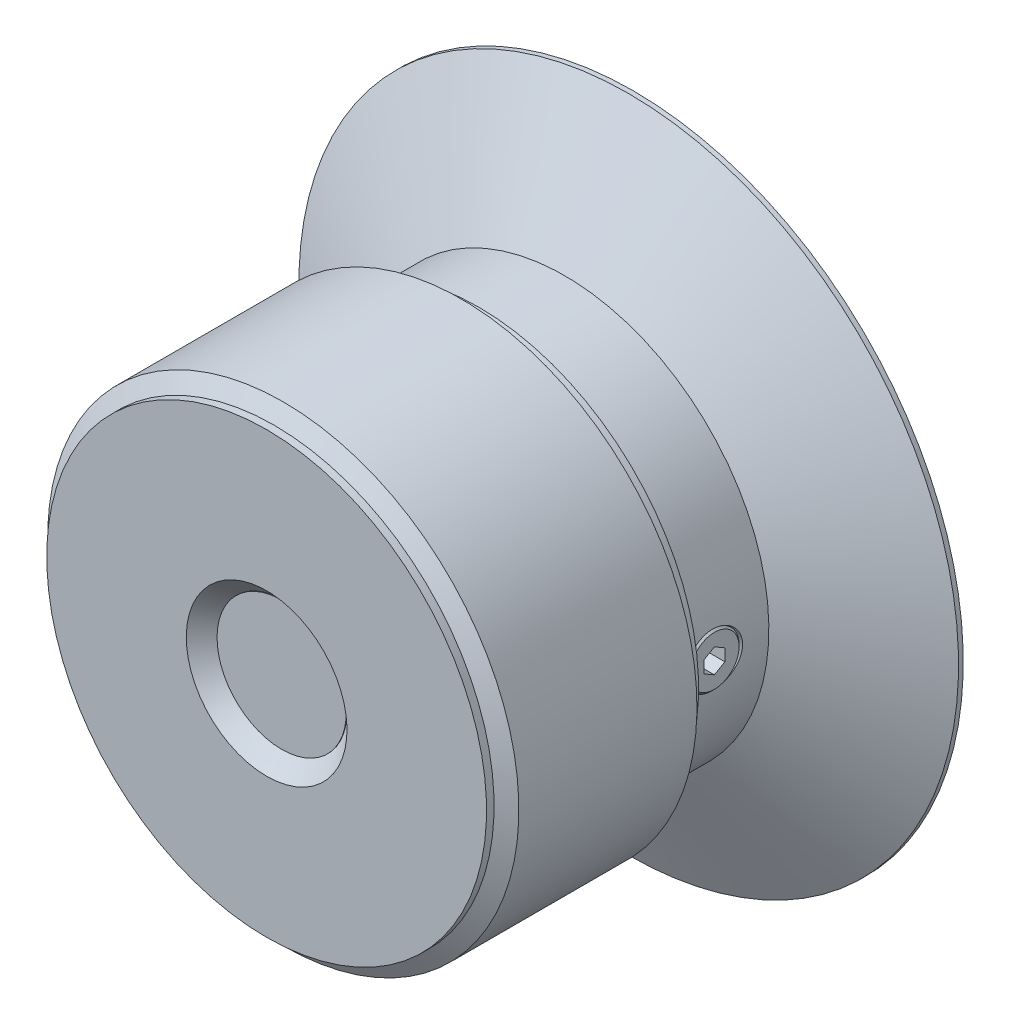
ISO-10303-21;
HEADER;
FILE_DESCRIPTION(('STEP AP214'),'2;1');
FILE_NAME('part.step','',(''),(''),'','','');
FILE_SCHEMA(('AUTOMOTIVE_DESIGN { 1 0 10303 214 1 1 1 1 }'));
ENDSEC;
DATA;
#1=APPLICATION_CONTEXT('core data for automotive mechanical design processes');
#2=APPLICATION_PROTOCOL_DEFINITION('international standard','automotive_design',2000,#1);
#3=PRODUCT_CONTEXT('',#1,'mechanical');
#4=PRODUCT('Part','Part','',(#3));
#5=PRODUCT_RELATED_PRODUCT_CATEGORY('part','',(#4));
#6=PRODUCT_DEFINITION_FORMATION('','',#4);
#7=PRODUCT_DEFINITION_CONTEXT('part definition',#1,'design');
#8=PRODUCT_DEFINITION('design','',#6,#7);
#9=PRODUCT_DEFINITION_SHAPE('','',#8);
#10=(LENGTH_UNIT() NAMED_UNIT(*) SI_UNIT(.MILLI.,.METRE.));
#11=(NAMED_UNIT(*) PLANE_ANGLE_UNIT() SI_UNIT($,.RADIAN.));
#12=(NAMED_UNIT(*) SI_UNIT($,.STERADIAN.) SOLID_ANGLE_UNIT());
#13=UNCERTAINTY_MEASURE_WITH_UNIT(LENGTH_MEASURE(1.E-05),#10,'distance_accuracy_value','');
#14=(GEOMETRIC_REPRESENTATION_CONTEXT(3) GLOBAL_UNCERTAINTY_ASSIGNED_CONTEXT((#13)) GLOBAL_UNIT_ASSIGNED_CONTEXT((#10,
#11,#12)) REPRESENTATION_CONTEXT('',''));
#15=CARTESIAN_POINT('',(0.,0.,0.));
#16=DIRECTION('',(0.,0.,1.));
#17=DIRECTION('',(1.,0.,0.));
#18=AXIS2_PLACEMENT_3D('',#15,#16,#17);
#19=CARTESIAN_POINT('',(0.,0.,11.025));
#20=DIRECTION('',(0.,0.,1.));
#21=DIRECTION('',(0.,-1.,0.));
#22=AXIS2_PLACEMENT_3D('',#19,#20,#21);
#23=CONICAL_SURFACE('',#22,14.,1.0471975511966);
#24=CARTESIAN_POINT('',(0.,0.,11.28));
#25=DIRECTION('',(0.,0.,1.));
#26=DIRECTION('',(0.,-1.,0.));
#27=AXIS2_PLACEMENT_3D('',#24,#25,#26);
#28=CIRCLE('',#27,14.4416729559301);
#29=CARTESIAN_POINT('',(0.,-14.4416729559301,11.28));
#30=VERTEX_POINT('',#29);
#31=EDGE_CURVE('E131',#30,#30,#28,.F.);
#32=ORIENTED_EDGE('',*,*,#31,.F.);
#33=EDGE_LOOP('',(#32));
#34=FACE_BOUND('',#33,.T.);
#35=CARTESIAN_POINT('',(0.,0.,11.6023502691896));
#36=DIRECTION('',(0.,0.,1.));
#37=DIRECTION('',(0.,-1.,0.));
#38=AXIS2_PLACEMENT_3D('',#35,#36,#37);
#39=CIRCLE('',#38,15.);
#40=CARTESIAN_POINT('',(0.,-15.,11.6023502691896));
#41=VERTEX_POINT('',#40);
#42=EDGE_CURVE('E126',#41,#41,#39,.T.);
#43=ORIENTED_EDGE('',*,*,#42,.F.);
#44=EDGE_LOOP('',(#43));
#45=FACE_BOUND('',#44,.T.);
#46=ADVANCED_FACE('F14',(#34,#45),#23,.T.);
#47=CARTESIAN_POINT('',(14.,0.,11.28));
#48=DIRECTION('',(0.,0.,1.));
#49=DIRECTION('',(0.,-1.,0.));
#50=AXIS2_PLACEMENT_3D('',#47,#48,#49);
#51=PLANE('',#50);
#52=ORIENTED_EDGE('',*,*,#31,.T.);
#53=EDGE_LOOP('',(#52));
#54=FACE_BOUND('',#53,.T.);
#55=CARTESIAN_POINT('',(0.,0.,11.28));
#56=DIRECTION('',(0.,0.,1.));
#57=DIRECTION('',(0.,-1.,0.));
#58=AXIS2_PLACEMENT_3D('',#55,#56,#57);
#59=CIRCLE('',#58,14.);
#60=CARTESIAN_POINT('',(0.,-14.,11.28));
#61=VERTEX_POINT('',#60);
#62=EDGE_CURVE('E263',#61,#61,#59,.T.);
#63=ORIENTED_EDGE('',*,*,#62,.T.);
#64=EDGE_LOOP('',(#63));
#65=FACE_BOUND('',#64,.T.);
#66=ADVANCED_FACE('F183',(#54,#65),#51,.F.);
#67=CARTESIAN_POINT('',(0.,0.,24.));
#68=DIRECTION('',(0.,0.,1.));
#69=DIRECTION('',(0.,-1.,0.));
#70=AXIS2_PLACEMENT_3D('',#67,#68,#69);
#71=CYLINDRICAL_SURFACE('',#70,14.);
#72=ORIENTED_EDGE('',*,*,#62,.F.);
#73=EDGE_LOOP('',(#72));
#74=FACE_BOUND('',#73,.T.);
#75=CARTESIAN_POINT('',(0.,0.,10.5));
#76=DIRECTION('',(0.,0.,1.));
#77=DIRECTION('',(0.,-1.,0.));
#78=AXIS2_PLACEMENT_3D('',#75,#76,#77);
#79=CIRCLE('',#78,14.);
#80=CARTESIAN_POINT('',(0.,-14.,10.5));
#81=VERTEX_POINT('',#80);
#82=EDGE_CURVE('E260',#81,#81,#79,.T.);
#83=ORIENTED_EDGE('',*,*,#82,.T.);
#84=EDGE_LOOP('',(#83));
#85=FACE_BOUND('',#84,.T.);
#86=ADVANCED_FACE('F186',(#74,#85),#71,.T.);
#87=CARTESIAN_POINT('',(13.,0.,10.5));
#88=DIRECTION('',(0.,0.,1.));
#89=DIRECTION('',(0.,-1.,0.));
#90=AXIS2_PLACEMENT_3D('',#87,#88,#89);
#91=PLANE('',#90);
#92=ORIENTED_EDGE('',*,*,#82,.F.);
#93=EDGE_LOOP('',(#92));
#94=FACE_BOUND('',#93,.T.);
#95=CARTESIAN_POINT('',(0.,0.,10.5));
#96=DIRECTION('',(0.,0.,1.));
#97=DIRECTION('',(0.,-1.,0.));
#98=AXIS2_PLACEMENT_3D('',#95,#96,#97);
#99=CIRCLE('',#98,13.);
#100=CARTESIAN_POINT('',(0.,-13.,10.5));
#101=VERTEX_POINT('',#100);
#102=EDGE_CURVE('E257',#101,#101,#99,.T.);
#103=ORIENTED_EDGE('',*,*,#102,.T.);
#104=EDGE_LOOP('',(#103));
#105=FACE_BOUND('',#104,.T.);
#106=ADVANCED_FACE('F189',(#94,#105),#91,.F.);
#107=CARTESIAN_POINT('',(0.,0.,24.));
#108=DIRECTION('',(0.,0.,1.));
#109=DIRECTION('',(0.,-1.,0.));
#110=AXIS2_PLACEMENT_3D('',#107,#108,#109);
#111=CYLINDRICAL_SURFACE('',#110,13.);
#112=ORIENTED_EDGE('',*,*,#102,.F.);
#113=EDGE_LOOP('',(#112));
#114=FACE_BOUND('',#113,.T.);
#115=CARTESIAN_POINT('',(12.9431972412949,-1.2139378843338,7.24896385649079));
#116=CARTESIAN_POINT('',(12.9486321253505,-1.15598715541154,7.18515845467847));
#117=CARTESIAN_POINT('',(12.95411531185,-1.09333814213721,7.12561511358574));
#118=CARTESIAN_POINT('',(12.9646981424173,-0.959734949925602,7.01659920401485));
#119=CARTESIAN_POINT('',(12.9697976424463,-0.888777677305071,6.96713040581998));
#120=CARTESIAN_POINT('',(12.9796922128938,-0.731114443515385,6.8745582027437));
#121=CARTESIAN_POINT('',(12.9843791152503,-0.643539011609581,6.83290954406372));
#122=CARTESIAN_POINT('',(12.9920939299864,-0.462285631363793,6.76586842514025));
#123=CARTESIAN_POINT('',(12.9951219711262,-0.368608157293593,6.74047470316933));
#124=CARTESIAN_POINT('',(12.9990116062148,-0.183704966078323,6.70807803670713));
#125=CARTESIAN_POINT('',(12.9999889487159,-0.0926534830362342,6.700091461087));
#126=CARTESIAN_POINT('',(13.0000108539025,0.089449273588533,6.69991016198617));
#127=CARTESIAN_POINT('',(12.9990559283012,0.180500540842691,6.70771125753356));
#128=CARTESIAN_POINT('',(12.9953821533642,0.357267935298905,6.73830549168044));
#129=CARTESIAN_POINT('',(12.9927152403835,0.443062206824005,6.76065747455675));
#130=CARTESIAN_POINT('',(12.9859588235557,0.609788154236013,6.81904806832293));
#131=CARTESIAN_POINT('',(12.9818691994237,0.690719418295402,6.85508783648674));
#132=CARTESIAN_POINT('',(12.9725844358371,0.84757191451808,6.94057061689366));
#133=CARTESIAN_POINT('',(12.9673654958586,0.923329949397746,6.99030972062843));
#134=CARTESIAN_POINT('',(12.9564197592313,1.06598100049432,7.10113316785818));
#135=CARTESIAN_POINT('',(12.9506928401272,1.13287186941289,7.16222025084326));
#136=CARTESIAN_POINT('',(12.9389544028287,1.2600718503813,7.29780227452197));
#137=CARTESIAN_POINT('',(12.9329457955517,1.31976847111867,7.37287188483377));
#138=CARTESIAN_POINT('',(12.9216017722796,1.42656910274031,7.53153062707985));
#139=CARTESIAN_POINT('',(12.9162665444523,1.47366959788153,7.61512212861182));
#140=CARTESIAN_POINT('',(12.9065129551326,1.55685279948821,7.79384493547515));
#141=CARTESIAN_POINT('',(12.902168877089,1.59210418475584,7.88936776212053));
#142=CARTESIAN_POINT('',(12.8952989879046,1.64682337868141,8.08489536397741));
#143=CARTESIAN_POINT('',(12.8927735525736,1.66628792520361,8.18490106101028));
#144=CARTESIAN_POINT('',(12.8897539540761,1.68949455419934,8.39056335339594));
#145=CARTESIAN_POINT('',(12.8893395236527,1.69261960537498,8.49629121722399));
#146=CARTESIAN_POINT('',(12.8908053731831,1.68141790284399,8.70681077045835));
#147=CARTESIAN_POINT('',(12.8926859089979,1.6670892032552,8.81160235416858));
#148=CARTESIAN_POINT('',(12.8985577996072,1.62103305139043,9.01832956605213));
#149=CARTESIAN_POINT('',(12.9025698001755,1.58913530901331,9.1202268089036));
#150=CARTESIAN_POINT('',(12.9122474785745,1.50847810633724,9.31705123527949));
#151=CARTESIAN_POINT('',(12.9179131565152,1.45971864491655,9.41197841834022));
#152=CARTESIAN_POINT('',(12.9301074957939,1.34738479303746,9.59027531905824));
#153=CARTESIAN_POINT('',(12.9366194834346,1.28408204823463,9.67381694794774));
#154=CARTESIAN_POINT('',(12.9497856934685,1.14367968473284,9.82838089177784));
#155=CARTESIAN_POINT('',(12.9564398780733,1.06658369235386,9.89940648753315));
#156=CARTESIAN_POINT('',(12.9687264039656,0.904652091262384,10.023101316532));
#157=CARTESIAN_POINT('',(12.9743926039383,0.820371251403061,10.0764922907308));
#158=CARTESIAN_POINT('',(12.9843644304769,0.64350485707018,10.1672429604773));
#159=CARTESIAN_POINT('',(12.9886707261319,0.550923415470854,10.2046105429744));
#160=CARTESIAN_POINT('',(12.9951321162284,0.366698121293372,10.2597300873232));
#161=CARTESIAN_POINT('',(12.9974106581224,0.275397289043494,10.2786160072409));
#162=CARTESIAN_POINT('',(13.0000092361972,0.0908797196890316,10.3001087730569));
#163=CARTESIAN_POINT('',(13.0003298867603,-0.00233640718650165,10.3027207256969));
#164=CARTESIAN_POINT('',(12.9990054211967,-0.183619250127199,10.2918100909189));
#165=CARTESIAN_POINT('',(12.9974471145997,-0.271730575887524,10.2790000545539));
#166=CARTESIAN_POINT('',(12.9926844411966,-0.444552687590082,10.2389514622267));
#167=CARTESIAN_POINT('',(12.9894800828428,-0.52926349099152,10.2117129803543));
#168=CARTESIAN_POINT('',(12.9817461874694,-0.693604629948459,10.1436187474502));
#169=CARTESIAN_POINT('',(12.9772078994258,-0.773197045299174,10.1026728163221));
#170=CARTESIAN_POINT('',(12.9672876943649,-0.924786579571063,10.0086453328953));
#171=CARTESIAN_POINT('',(12.9619056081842,-0.996782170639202,9.95556134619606));
#172=CARTESIAN_POINT('',(12.9505479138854,-1.13506323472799,9.83595881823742));
#173=CARTESIAN_POINT('',(12.9445560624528,-1.20087773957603,9.76889783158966));
#174=CARTESIAN_POINT('',(12.9328387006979,-1.32111359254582,9.62522707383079));
#175=CARTESIAN_POINT('',(12.9271132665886,-1.37553169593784,9.54861459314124));
#176=CARTESIAN_POINT('',(12.9161522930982,-1.47501837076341,9.38282948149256));
#177=CARTESIAN_POINT('',(12.9109703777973,-1.51928144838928,9.29316954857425));
#178=CARTESIAN_POINT('',(12.9020876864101,-1.59295783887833,9.10787719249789));
#179=CARTESIAN_POINT('',(12.8983872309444,-1.62236793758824,9.01224348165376));
#180=CARTESIAN_POINT('',(12.8927224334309,-1.66680583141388,8.81297257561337));
#181=CARTESIAN_POINT('',(12.8908463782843,-1.68110490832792,8.70916981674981));
#182=CARTESIAN_POINT('',(12.8893456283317,-1.69257262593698,8.50058694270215));
#183=CARTESIAN_POINT('',(12.889721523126,-1.68973678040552,8.39580657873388));
#184=CARTESIAN_POINT('',(12.8927120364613,-1.66676732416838,8.18617317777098));
#185=CARTESIAN_POINT('',(12.8953689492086,-1.64630689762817,8.08135639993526));
#186=CARTESIAN_POINT('',(12.9026710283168,-1.58806063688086,7.87674996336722));
#187=CARTESIAN_POINT('',(12.9073151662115,-1.55028376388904,7.77695773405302));
#188=CARTESIAN_POINT('',(12.9170722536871,-1.46651756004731,7.60264189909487));
#189=CARTESIAN_POINT('',(12.9219511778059,-1.4232219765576,7.52679908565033));
#190=CARTESIAN_POINT('',(12.9322695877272,-1.32619043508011,7.3821790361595));
#191=CARTESIAN_POINT('',(12.9377087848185,-1.27245984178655,7.31339819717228));
#192=CARTESIAN_POINT('',(12.9431972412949,-1.2139378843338,7.24896385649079));
#193=B_SPLINE_CURVE_WITH_KNOTS('',3,(#115,#116,#117,#118,#119,#120,#121,#122,#123,#124,#125,
#126,#127,#128,#129,#130,#131,#132,#133,#134,#135,#136,#137,#138,#139,#140,#141,#142,#143,#144,
#145,#146,#147,#148,#149,#150,#151,#152,#153,#154,#155,#156,#157,#158,#159,#160,#161,#162,#163,
#164,#165,#166,#167,#168,#169,#170,#171,#172,#173,#174,#175,#176,#177,#178,#179,#180,#181,#182,
#183,#184,#185,#186,#187,#188,#189,#190,#191,#192),.UNSPECIFIED.,.T.,.F.,(4,2,2,2,2,2,2,2,2,2,2,
2,2,2,2,2,2,2,2,2,2,2,2,2,2,2,2,2,2,2,2,2,2,2,2,2,2,2,4),(0.,0.258856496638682,
0.517809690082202,0.807531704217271,1.0972312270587,1.37008332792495,1.64286318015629,
1.90773549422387,2.17263020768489,2.44377298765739,2.71498130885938,3.00202784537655,
3.28915441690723,3.59352050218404,3.89794946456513,4.21379569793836,4.52967714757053,
4.84867561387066,5.16767410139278,5.48113933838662,5.79452228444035,6.09274637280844,
6.39082350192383,6.66918488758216,6.94745891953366,7.21335437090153,7.47924845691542,
7.74692738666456,8.01466004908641,8.29589258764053,8.57720508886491,8.87624874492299,
9.17535708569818,9.4883101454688,9.80134514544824,10.1203129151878,10.4391158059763,
10.7006579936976,10.9620660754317),.UNSPECIFIED.);
#194=CARTESIAN_POINT('',(12.9431972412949,-1.2139378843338,7.24896385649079));
#195=VERTEX_POINT('',#194);
#196=EDGE_CURVE('E143',#195,#195,#193,.T.);
#197=ORIENTED_EDGE('',*,*,#196,.F.);
#198=EDGE_LOOP('',(#197));
#199=FACE_BOUND('',#198,.T.);
#200=CARTESIAN_POINT('',(0.,0.,5.02620359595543));
#201=DIRECTION('',(0.,0.,1.));
#202=DIRECTION('',(0.,-1.,0.));
#203=AXIS2_PLACEMENT_3D('',#200,#201,#202);
#204=CIRCLE('',#203,13.);
#205=CARTESIAN_POINT('',(0.,-13.,5.02620359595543));
#206=VERTEX_POINT('',#205);
#207=EDGE_CURVE('E254',#206,#206,#204,.T.);
#208=ORIENTED_EDGE('',*,*,#207,.T.);
#209=EDGE_LOOP('',(#208));
#210=FACE_BOUND('',#209,.T.);
#211=ADVANCED_FACE('F153',(#114,#199,#210),#111,.T.);
#212=CARTESIAN_POINT('',(13.2,0.,8.5));
#213=DIRECTION('',(1.,0.,0.));
#214=DIRECTION('',(0.,0.,-1.));
#215=AXIS2_PLACEMENT_3D('',#212,#213,#214);
#216=CONICAL_SURFACE('',#215,2.,0.78539816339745);
#217=ORIENTED_EDGE('',*,*,#196,.T.);
#218=EDGE_LOOP('',(#217));
#219=FACE_BOUND('',#218,.T.);
#220=CARTESIAN_POINT('',(12.8880760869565,0.,8.5));
#221=DIRECTION('',(-1.,0.,0.));
#222=DIRECTION('',(0.,-1.,0.));
#223=AXIS2_PLACEMENT_3D('',#220,#221,#222);
#224=CIRCLE('',#223,1.68807608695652);
#225=CARTESIAN_POINT('',(12.8880760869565,-1.68807608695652,8.5));
#226=VERTEX_POINT('',#225);
#227=EDGE_CURVE('E95',#226,#226,#224,.T.);
#228=ORIENTED_EDGE('',*,*,#227,.T.);
#229=EDGE_LOOP('',(#228));
#230=FACE_BOUND('',#229,.T.);
#231=ADVANCED_FACE('F157',(#219,#230),#216,.F.);
#232=CARTESIAN_POINT('',(0.,0.,0.95));
#233=DIRECTION('',(0.,0.,-1.));
#234=DIRECTION('',(0.,1.,0.));
#235=AXIS2_PLACEMENT_3D('',#232,#233,#234);
#236=CONICAL_SURFACE('',#235,21.,1.09955742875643);
#237=ORIENTED_EDGE('',*,*,#207,.F.);
#238=EDGE_LOOP('',(#237));
#239=FACE_BOUND('',#238,.T.);
#240=CARTESIAN_POINT('',(0.,0.,0.95));
#241=DIRECTION('',(0.,0.,1.));
#242=DIRECTION('',(0.,-1.,0.));
#243=AXIS2_PLACEMENT_3D('',#240,#241,#242);
#244=CIRCLE('',#243,21.);
#245=CARTESIAN_POINT('',(0.,-21.,0.95));
#246=VERTEX_POINT('',#245);
#247=EDGE_CURVE('E251',#246,#246,#244,.T.);
#248=ORIENTED_EDGE('',*,*,#247,.T.);
#249=EDGE_LOOP('',(#248));
#250=FACE_BOUND('',#249,.T.);
#251=ADVANCED_FACE('F162',(#239,#250),#236,.T.);
#252=CARTESIAN_POINT('',(13.005652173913,0.,8.5));
#253=DIRECTION('',(-1.,0.,0.));
#254=DIRECTION('',(0.,-1.,0.));
#255=AXIS2_PLACEMENT_3D('',#252,#253,#254);
#256=CONICAL_SURFACE('',#255,1.5705,0.785398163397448);
#257=ORIENTED_EDGE('',*,*,#227,.F.);
#258=EDGE_LOOP('',(#257));
#259=FACE_BOUND('',#258,.T.);
#260=CARTESIAN_POINT('',(13.005652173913,0.,8.5));
#261=DIRECTION('',(-1.,0.,0.));
#262=DIRECTION('',(0.,-1.,0.));
#263=AXIS2_PLACEMENT_3D('',#260,#261,#262);
#264=CIRCLE('',#263,1.5705);
#265=CARTESIAN_POINT('',(13.005652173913,-1.5705,8.5));
#266=VERTEX_POINT('',#265);
#267=EDGE_CURVE('E74',#266,#266,#264,.T.);
#268=ORIENTED_EDGE('',*,*,#267,.T.);
#269=EDGE_LOOP('',(#268));
#270=FACE_BOUND('',#269,.T.);
#271=ADVANCED_FACE('F291',(#259,#270),#256,.T.);
#272=CARTESIAN_POINT('',(0.,0.,24.));
#273=DIRECTION('',(0.,0.,1.));
#274=DIRECTION('',(0.,-1.,0.));
#275=AXIS2_PLACEMENT_3D('',#272,#273,#274);
#276=CYLINDRICAL_SURFACE('',#275,21.);
#277=ORIENTED_EDGE('',*,*,#247,.F.);
#278=EDGE_LOOP('',(#277));
#279=FACE_BOUND('',#278,.T.);
#280=CARTESIAN_POINT('',(0.,0.,0.65));
#281=DIRECTION('',(0.,0.,1.));
#282=DIRECTION('',(0.,-1.,0.));
#283=AXIS2_PLACEMENT_3D('',#280,#281,#282);
#284=CIRCLE('',#283,21.);
#285=CARTESIAN_POINT('',(0.,-21.,0.65));
#286=VERTEX_POINT('',#285);
#287=EDGE_CURVE('E248',#286,#286,#284,.T.);
#288=ORIENTED_EDGE('',*,*,#287,.T.);
#289=EDGE_LOOP('',(#288));
#290=FACE_BOUND('',#289,.T.);
#291=ADVANCED_FACE('F294',(#279,#290),#276,.T.);
#292=CARTESIAN_POINT('',(13.005652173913,0.,8.5));
#293=DIRECTION('',(-1.,0.,0.));
#294=DIRECTION('',(0.,-1.,0.));
#295=AXIS2_PLACEMENT_3D('',#292,#293,#294);
#296=PLANE('',#295);
#297=ORIENTED_EDGE('',*,*,#267,.F.);
#298=EDGE_LOOP('',(#297));
#299=FACE_BOUND('',#298,.T.);
#300=DIRECTION('',(0.,1.,0.));
#301=VECTOR('',#300,1.);
#302=CARTESIAN_POINT('',(13.005652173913,0.,7.83333333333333));
#303=LINE('',#302,#301);
#304=CARTESIAN_POINT('',(13.005652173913,-0.384900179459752,7.83333333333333));
#305=VERTEX_POINT('',#304);
#306=CARTESIAN_POINT('',(13.005652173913,0.384900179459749,7.83333333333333));
#307=VERTEX_POINT('',#306);
#308=EDGE_CURVE('E18',#305,#307,#303,.T.);
#309=ORIENTED_EDGE('',*,*,#308,.F.);
#310=DIRECTION('',(0.,0.5,-0.866025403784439));
#311=VECTOR('',#310,1.);
#312=CARTESIAN_POINT('',(13.005652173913,-0.577350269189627,8.16666666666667));
#313=LINE('',#312,#311);
#314=CARTESIAN_POINT('',(13.005652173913,-0.769800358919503,8.5));
#315=VERTEX_POINT('',#314);
#316=EDGE_CURVE('E115',#315,#305,#313,.T.);
#317=ORIENTED_EDGE('',*,*,#316,.F.);
#318=DIRECTION('',(0.,-0.5,-0.866025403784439));
#319=VECTOR('',#318,1.);
#320=CARTESIAN_POINT('',(13.005652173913,-0.577350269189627,8.83333333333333));
#321=LINE('',#320,#319);
#322=CARTESIAN_POINT('',(13.005652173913,-0.384900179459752,9.16666666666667));
#323=VERTEX_POINT('',#322);
#324=EDGE_CURVE('E117',#323,#315,#321,.T.);
#325=ORIENTED_EDGE('',*,*,#324,.F.);
#326=DIRECTION('',(0.,-1.,0.));
#327=VECTOR('',#326,1.);
#328=CARTESIAN_POINT('',(13.005652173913,0.,9.16666666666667));
#329=LINE('',#328,#327);
#330=CARTESIAN_POINT('',(13.005652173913,0.384900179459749,9.16666666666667));
#331=VERTEX_POINT('',#330);
#332=EDGE_CURVE('E119',#331,#323,#329,.T.);
#333=ORIENTED_EDGE('',*,*,#332,.F.);
#334=DIRECTION('',(0.,-0.5,0.866025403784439));
#335=VECTOR('',#334,1.);
#336=CARTESIAN_POINT('',(13.005652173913,0.577350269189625,8.83333333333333));
#337=LINE('',#336,#335);
#338=CARTESIAN_POINT('',(13.005652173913,0.7698003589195,8.5));
#339=VERTEX_POINT('',#338);
#340=EDGE_CURVE('E121',#339,#331,#337,.T.);
#341=ORIENTED_EDGE('',*,*,#340,.F.);
#342=DIRECTION('',(0.,0.5,0.866025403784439));
#343=VECTOR('',#342,1.);
#344=CARTESIAN_POINT('',(13.005652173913,0.577350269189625,8.16666666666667));
#345=LINE('',#344,#343);
#346=EDGE_CURVE('E123',#307,#339,#345,.T.);
#347=ORIENTED_EDGE('',*,*,#346,.F.);
#348=EDGE_LOOP('',(#309,#317,#325,#333,#341,#347));
#349=FACE_BOUND('',#348,.T.);
#350=ADVANCED_FACE('F16',(#299,#349),#296,.F.);
#351=CARTESIAN_POINT('',(6.6,0.,0.65));
#352=DIRECTION('',(0.,0.,1.));
#353=DIRECTION('',(0.,-1.,0.));
#354=AXIS2_PLACEMENT_3D('',#351,#352,#353);
#355=PLANE('',#354);
#356=ORIENTED_EDGE('',*,*,#287,.F.);
#357=EDGE_LOOP('',(#356));
#358=FACE_BOUND('',#357,.T.);
#359=CARTESIAN_POINT('',(0.,0.,0.65));
#360=DIRECTION('',(0.,0.,1.));
#361=DIRECTION('',(0.,-1.,0.));
#362=AXIS2_PLACEMENT_3D('',#359,#360,#361);
#363=CIRCLE('',#362,6.6);
#364=CARTESIAN_POINT('',(0.,-6.6,0.65));
#365=VERTEX_POINT('',#364);
#366=EDGE_CURVE('E245',#365,#365,#363,.T.);
#367=ORIENTED_EDGE('',*,*,#366,.T.);
#368=EDGE_LOOP('',(#367));
#369=FACE_BOUND('',#368,.T.);
#370=ADVANCED_FACE('F300',(#358,#369),#355,.F.);
#371=CARTESIAN_POINT('',(15.,-0.384900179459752,7.83333333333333));
#372=DIRECTION('',(0.,0.,1.));
#373=DIRECTION('',(0.,-1.,0.));
#374=AXIS2_PLACEMENT_3D('',#371,#372,#373);
#375=PLANE('',#374);
#376=ORIENTED_EDGE('',*,*,#308,.T.);
#377=DIRECTION('',(-1.,0.,0.));
#378=VECTOR('',#377,1.);
#379=CARTESIAN_POINT('',(15.,0.384900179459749,7.83333333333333));
#380=LINE('',#379,#378);
#381=CARTESIAN_POINT('',(11.,0.384900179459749,7.83333333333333));
#382=VERTEX_POINT('',#381);
#383=EDGE_CURVE('E67',#307,#382,#380,.T.);
#384=ORIENTED_EDGE('',*,*,#383,.T.);
#385=DIRECTION('',(0.,1.,0.));
#386=VECTOR('',#385,1.);
#387=CARTESIAN_POINT('',(11.,-0.384900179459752,7.83333333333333));
#388=LINE('',#387,#386);
#389=CARTESIAN_POINT('',(11.,-0.384900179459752,7.83333333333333));
#390=VERTEX_POINT('',#389);
#391=EDGE_CURVE('E71',#390,#382,#388,.T.);
#392=ORIENTED_EDGE('',*,*,#391,.F.);
#393=DIRECTION('',(-1.,0.,0.));
#394=VECTOR('',#393,1.);
#395=CARTESIAN_POINT('',(15.,-0.384900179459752,7.83333333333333));
#396=LINE('',#395,#394);
#397=EDGE_CURVE('E105',#305,#390,#396,.T.);
#398=ORIENTED_EDGE('',*,*,#397,.F.);
#399=EDGE_LOOP('',(#376,#384,#392,#398));
#400=FACE_BOUND('',#399,.T.);
#401=ADVANCED_FACE('F69',(#400),#375,.T.);
#402=CARTESIAN_POINT('',(15.,-0.769800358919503,8.5));
#403=DIRECTION('',(0.,0.866025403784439,0.5));
#404=DIRECTION('',(0.,-0.5,0.866025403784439));
#405=AXIS2_PLACEMENT_3D('',#402,#403,#404);
#406=PLANE('',#405);
#407=ORIENTED_EDGE('',*,*,#316,.T.);
#408=ORIENTED_EDGE('',*,*,#397,.T.);
#409=DIRECTION('',(0.,0.5,-0.866025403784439));
#410=VECTOR('',#409,1.);
#411=CARTESIAN_POINT('',(11.,-0.769800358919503,8.5));
#412=LINE('',#411,#410);
#413=CARTESIAN_POINT('',(11.,-0.769800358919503,8.5));
#414=VERTEX_POINT('',#413);
#415=EDGE_CURVE('E89',#414,#390,#412,.T.);
#416=ORIENTED_EDGE('',*,*,#415,.F.);
#417=DIRECTION('',(-1.,0.,0.));
#418=VECTOR('',#417,1.);
#419=CARTESIAN_POINT('',(15.,-0.769800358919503,8.5));
#420=LINE('',#419,#418);
#421=EDGE_CURVE('E31',#315,#414,#420,.T.);
#422=ORIENTED_EDGE('',*,*,#421,.F.);
#423=EDGE_LOOP('',(#407,#408,#416,#422));
#424=FACE_BOUND('',#423,.T.);
#425=ADVANCED_FACE('F329',(#424),#406,.T.);
#426=CARTESIAN_POINT('',(15.,-0.384900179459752,9.16666666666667));
#427=DIRECTION('',(0.,0.866025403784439,-0.5));
#428=DIRECTION('',(0.,0.5,0.866025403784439));
#429=AXIS2_PLACEMENT_3D('',#426,#427,#428);
#430=PLANE('',#429);
#431=ORIENTED_EDGE('',*,*,#324,.T.);
#432=ORIENTED_EDGE('',*,*,#421,.T.);
#433=DIRECTION('',(0.,-0.5,-0.866025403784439));
#434=VECTOR('',#433,1.);
#435=CARTESIAN_POINT('',(11.,-0.384900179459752,9.16666666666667));
#436=LINE('',#435,#434);
#437=CARTESIAN_POINT('',(11.,-0.384900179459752,9.16666666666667));
#438=VERTEX_POINT('',#437);
#439=EDGE_CURVE('E102',#438,#414,#436,.T.);
#440=ORIENTED_EDGE('',*,*,#439,.F.);
#441=DIRECTION('',(-1.,0.,0.));
#442=VECTOR('',#441,1.);
#443=CARTESIAN_POINT('',(15.,-0.384900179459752,9.16666666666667));
#444=LINE('',#443,#442);
#445=EDGE_CURVE('E108',#323,#438,#444,.T.);
#446=ORIENTED_EDGE('',*,*,#445,.F.);
#447=EDGE_LOOP('',(#431,#432,#440,#446));
#448=FACE_BOUND('',#447,.T.);
#449=ADVANCED_FACE('F332',(#448),#430,.T.);
#450=CARTESIAN_POINT('',(15.,0.384900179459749,9.16666666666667));
#451=DIRECTION('',(0.,0.,-1.));
#452=DIRECTION('',(0.,1.,0.));
#453=AXIS2_PLACEMENT_3D('',#450,#451,#452);
#454=PLANE('',#453);
#455=DIRECTION('',(-1.,0.,0.));
#456=VECTOR('',#455,1.);
#457=CARTESIAN_POINT('',(15.,0.384900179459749,9.16666666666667));
#458=LINE('',#457,#456);
#459=CARTESIAN_POINT('',(11.,0.384900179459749,9.16666666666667));
#460=VERTEX_POINT('',#459);
#461=EDGE_CURVE('E110',#331,#460,#458,.T.);
#462=ORIENTED_EDGE('',*,*,#461,.F.);
#463=ORIENTED_EDGE('',*,*,#332,.T.);
#464=ORIENTED_EDGE('',*,*,#445,.T.);
#465=DIRECTION('',(0.,-1.,0.));
#466=VECTOR('',#465,1.);
#467=CARTESIAN_POINT('',(11.,0.384900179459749,9.16666666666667));
#468=LINE('',#467,#466);
#469=EDGE_CURVE('E99',#460,#438,#468,.T.);
#470=ORIENTED_EDGE('',*,*,#469,.F.);
#471=EDGE_LOOP('',(#462,#463,#464,#470));
#472=FACE_BOUND('',#471,.T.);
#473=ADVANCED_FACE('F335',(#472),#454,.T.);
#474=CARTESIAN_POINT('',(15.,0.7698003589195,8.5));
#475=DIRECTION('',(0.,-0.866025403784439,-0.5));
#476=DIRECTION('',(0.,0.5,-0.866025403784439));
#477=AXIS2_PLACEMENT_3D('',#474,#475,#476);
#478=PLANE('',#477);
#479=ORIENTED_EDGE('',*,*,#340,.T.);
#480=ORIENTED_EDGE('',*,*,#461,.T.);
#481=DIRECTION('',(0.,-0.5,0.866025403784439));
#482=VECTOR('',#481,1.);
#483=CARTESIAN_POINT('',(11.,0.7698003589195,8.5));
#484=LINE('',#483,#482);
#485=CARTESIAN_POINT('',(11.,0.7698003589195,8.5));
#486=VERTEX_POINT('',#485);
#487=EDGE_CURVE('E84',#486,#460,#484,.T.);
#488=ORIENTED_EDGE('',*,*,#487,.F.);
#489=DIRECTION('',(-1.,0.,0.));
#490=VECTOR('',#489,1.);
#491=CARTESIAN_POINT('',(15.,0.7698003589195,8.5));
#492=LINE('',#491,#490);
#493=EDGE_CURVE('E75',#339,#486,#492,.T.);
#494=ORIENTED_EDGE('',*,*,#493,.F.);
#495=EDGE_LOOP('',(#479,#480,#488,#494));
#496=FACE_BOUND('',#495,.T.);
#497=ADVANCED_FACE('F339',(#496),#478,.T.);
#498=CARTESIAN_POINT('',(15.,0.384900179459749,7.83333333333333));
#499=DIRECTION('',(0.,-0.866025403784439,0.5));
#500=DIRECTION('',(0.,-0.5,-0.866025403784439));
#501=AXIS2_PLACEMENT_3D('',#498,#499,#500);
#502=PLANE('',#501);
#503=ORIENTED_EDGE('',*,*,#346,.T.);
#504=ORIENTED_EDGE('',*,*,#493,.T.);
#505=DIRECTION('',(0.,0.5,0.866025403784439));
#506=VECTOR('',#505,1.);
#507=CARTESIAN_POINT('',(11.,0.384900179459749,7.83333333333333));
#508=LINE('',#507,#506);
#509=EDGE_CURVE('E78',#382,#486,#508,.T.);
#510=ORIENTED_EDGE('',*,*,#509,.F.);
#511=ORIENTED_EDGE('',*,*,#383,.F.);
#512=EDGE_LOOP('',(#503,#504,#510,#511));
#513=FACE_BOUND('',#512,.T.);
#514=ADVANCED_FACE('F79',(#513),#502,.T.);
#515=CARTESIAN_POINT('',(0.,0.,0.3));
#516=DIRECTION('',(0.,0.,1.));
#517=DIRECTION('',(0.,-1.,0.));
#518=AXIS2_PLACEMENT_3D('',#515,#516,#517);
#519=CONICAL_SURFACE('',#518,6.,1.04272187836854);
#520=ORIENTED_EDGE('',*,*,#366,.F.);
#521=EDGE_LOOP('',(#520));
#522=FACE_BOUND('',#521,.T.);
#523=CARTESIAN_POINT('',(0.,0.,0.3));
#524=DIRECTION('',(0.,0.,1.));
#525=DIRECTION('',(0.,-1.,0.));
#526=AXIS2_PLACEMENT_3D('',#523,#524,#525);
#527=CIRCLE('',#526,6.);
#528=CARTESIAN_POINT('',(0.,-6.,0.3));
#529=VERTEX_POINT('',#528);
#530=EDGE_CURVE('E240',#529,#529,#527,.T.);
#531=ORIENTED_EDGE('',*,*,#530,.T.);
#532=EDGE_LOOP('',(#531));
#533=FACE_BOUND('',#532,.T.);
#534=ADVANCED_FACE('F306',(#522,#533),#519,.T.);
#535=CARTESIAN_POINT('',(11.,0.,8.5));
#536=DIRECTION('',(1.,0.,0.));
#537=DIRECTION('',(0.,1.,0.));
#538=AXIS2_PLACEMENT_3D('',#535,#536,#537);
#539=PLANE('',#538);
#540=ORIENTED_EDGE('',*,*,#391,.T.);
#541=ORIENTED_EDGE('',*,*,#509,.T.);
#542=ORIENTED_EDGE('',*,*,#487,.T.);
#543=ORIENTED_EDGE('',*,*,#469,.T.);
#544=ORIENTED_EDGE('',*,*,#439,.T.);
#545=ORIENTED_EDGE('',*,*,#415,.T.);
#546=EDGE_LOOP('',(#540,#541,#542,#543,#544,#545));
#547=FACE_BOUND('',#546,.T.);
#548=ADVANCED_FACE('F87',(#547),#539,.T.);
#549=CARTESIAN_POINT('',(5.5,0.,0.3));
#550=DIRECTION('',(0.,0.,1.));
#551=DIRECTION('',(0.,-1.,0.));
#552=AXIS2_PLACEMENT_3D('',#549,#550,#551);
#553=PLANE('',#552);
#554=ORIENTED_EDGE('',*,*,#530,.F.);
#555=EDGE_LOOP('',(#554));
#556=FACE_BOUND('',#555,.T.);
#557=CARTESIAN_POINT('',(0.,0.,0.3));
#558=DIRECTION('',(0.,0.,1.));
#559=DIRECTION('',(0.,-1.,0.));
#560=AXIS2_PLACEMENT_3D('',#557,#558,#559);
#561=CIRCLE('',#560,5.5);
#562=CARTESIAN_POINT('',(0.,-5.5,0.3));
#563=VERTEX_POINT('',#562);
#564=EDGE_CURVE('E236',#563,#563,#561,.T.);
#565=ORIENTED_EDGE('',*,*,#564,.T.);
#566=EDGE_LOOP('',(#565));
#567=FACE_BOUND('',#566,.T.);
#568=ADVANCED_FACE('F312',(#556,#567),#553,.F.);
#569=CARTESIAN_POINT('',(0.,0.,24.));
#570=DIRECTION('',(0.,0.,1.));
#571=DIRECTION('',(0.,-1.,0.));
#572=AXIS2_PLACEMENT_3D('',#569,#570,#571);
#573=CYLINDRICAL_SURFACE('',#572,5.5);
#574=ORIENTED_EDGE('',*,*,#564,.F.);
#575=EDGE_LOOP('',(#574));
#576=FACE_BOUND('',#575,.T.);
#577=CARTESIAN_POINT('',(0.,0.,0.));
#578=DIRECTION('',(0.,0.,1.));
#579=DIRECTION('',(0.,-1.,0.));
#580=AXIS2_PLACEMENT_3D('',#577,#578,#579);
#581=CIRCLE('',#580,5.5);
#582=CARTESIAN_POINT('',(0.,-5.5,0.));
#583=VERTEX_POINT('',#582);
#584=EDGE_CURVE('E232',#583,#583,#581,.T.);
#585=ORIENTED_EDGE('',*,*,#584,.T.);
#586=EDGE_LOOP('',(#585));
#587=FACE_BOUND('',#586,.T.);
#588=ADVANCED_FACE('F315',(#576,#587),#573,.T.);
#589=CARTESIAN_POINT('',(0.,0.,0.));
#590=DIRECTION('',(0.,0.,1.));
#591=DIRECTION('',(0.,-1.,0.));
#592=AXIS2_PLACEMENT_3D('',#589,#590,#591);
#593=PLANE('',#592);
#594=ORIENTED_EDGE('',*,*,#584,.F.);
#595=EDGE_LOOP('',(#594));
#596=FACE_BOUND('',#595,.T.);
#597=CARTESIAN_POINT('',(0.,0.,0.));
#598=DIRECTION('',(0.,0.,1.));
#599=DIRECTION('',(0.,-1.,0.));
#600=AXIS2_PLACEMENT_3D('',#597,#598,#599);
#601=CIRCLE('',#600,2.7);
#602=CARTESIAN_POINT('',(0.,-2.7,0.));
#603=VERTEX_POINT('',#602);
#604=EDGE_CURVE('E140',#603,#603,#601,.T.);
#605=ORIENTED_EDGE('',*,*,#604,.T.);
#606=EDGE_LOOP('',(#605));
#607=FACE_BOUND('',#606,.T.);
#608=ADVANCED_FACE('F211',(#596,#607),#593,.F.);
#609=CARTESIAN_POINT('',(0.,0.,0.));
#610=DIRECTION('',(0.,0.,-1.));
#611=DIRECTION('',(0.,1.,0.));
#612=AXIS2_PLACEMENT_3D('',#609,#610,#611);
#613=CONICAL_SURFACE('',#612,2.7,0.785398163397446);
#614=CARTESIAN_POINT('',(0.,0.,0.2));
#615=DIRECTION('',(0.,0.,1.));
#616=DIRECTION('',(0.,-1.,0.));
#617=AXIS2_PLACEMENT_3D('',#614,#615,#616);
#618=CIRCLE('',#617,2.5);
#619=CARTESIAN_POINT('',(0.,-2.5,0.2));
#620=VERTEX_POINT('',#619);
#621=EDGE_CURVE('E137',#620,#620,#618,.T.);
#622=ORIENTED_EDGE('',*,*,#621,.T.);
#623=EDGE_LOOP('',(#622));
#624=FACE_BOUND('',#623,.T.);
#625=ORIENTED_EDGE('',*,*,#604,.F.);
#626=EDGE_LOOP('',(#625));
#627=FACE_BOUND('',#626,.T.);
#628=ADVANCED_FACE('F164',(#624,#627),#613,.F.);
#629=CARTESIAN_POINT('',(0.,0.,13.4433756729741));
#630=DIRECTION('',(0.,0.,1.));
#631=DIRECTION('',(0.,-1.,0.));
#632=AXIS2_PLACEMENT_3D('',#629,#630,#631);
#633=CYLINDRICAL_SURFACE('',#632,2.5);
#634=ORIENTED_EDGE('',*,*,#621,.F.);
#635=EDGE_LOOP('',(#634));
#636=FACE_BOUND('',#635,.T.);
#637=CARTESIAN_POINT('',(0.,0.,12.));
#638=DIRECTION('',(0.,0.,-1.));
#639=DIRECTION('',(0.,1.,0.));
#640=AXIS2_PLACEMENT_3D('',#637,#638,#639);
#641=CIRCLE('',#640,2.5);
#642=CARTESIAN_POINT('',(0.,2.5,12.));
#643=VERTEX_POINT('',#642);
#644=EDGE_CURVE('E90',#643,#643,#641,.T.);
#645=ORIENTED_EDGE('',*,*,#644,.F.);
#646=EDGE_LOOP('',(#645));
#647=FACE_BOUND('',#646,.T.);
#648=ADVANCED_FACE('F200',(#636,#647),#633,.F.);
#649=CARTESIAN_POINT('',(0.,0.,12.));
#650=DIRECTION('',(0.,0.,-1.));
#651=DIRECTION('',(0.,1.,0.));
#652=AXIS2_PLACEMENT_3D('',#649,#650,#651);
#653=PLANE('',#652);
#654=ORIENTED_EDGE('',*,*,#644,.T.);
#655=EDGE_LOOP('',(#654));
#656=FACE_BOUND('',#655,.T.);
#657=ADVANCED_FACE('F202',(#656),#653,.T.);
#658=CARTESIAN_POINT('',(4.11627906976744,0.,23.04));
#659=DIRECTION('',(0.,0.,-1.));
#660=DIRECTION('',(0.,1.,0.));
#661=AXIS2_PLACEMENT_3D('',#658,#659,#660);
#662=PLANE('',#661);
#663=CARTESIAN_POINT('',(0.,0.,23.04));
#664=DIRECTION('',(0.,0.,1.));
#665=DIRECTION('',(0.,-1.,0.));
#666=AXIS2_PLACEMENT_3D('',#663,#664,#665);
#667=CIRCLE('',#666,4.11627906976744);
#668=CARTESIAN_POINT('',(0.,-4.11627906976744,23.04));
#669=VERTEX_POINT('',#668);
#670=EDGE_CURVE('E23',#669,#669,#667,.T.);
#671=ORIENTED_EDGE('',*,*,#670,.T.);
#672=EDGE_LOOP('',(#671));
#673=FACE_BOUND('',#672,.T.);
#674=ADVANCED_FACE('F208',(#673),#662,.F.);
#675=CARTESIAN_POINT('',(0.,0.,23.04));
#676=DIRECTION('',(0.,0.,1.));
#677=DIRECTION('',(0.,-1.,0.));
#678=AXIS2_PLACEMENT_3D('',#675,#676,#677);
#679=CYLINDRICAL_SURFACE('',#678,4.11627906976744);
#680=ORIENTED_EDGE('',*,*,#670,.F.);
#681=EDGE_LOOP('',(#680));
#682=FACE_BOUND('',#681,.T.);
#683=CARTESIAN_POINT('',(0.,0.,23.));
#684=DIRECTION('',(0.,0.,1.));
#685=DIRECTION('',(0.,-1.,0.));
#686=AXIS2_PLACEMENT_3D('',#683,#684,#685);
#687=CIRCLE('',#686,4.11627906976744);
#688=CARTESIAN_POINT('',(0.,-4.11627906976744,23.));
#689=VERTEX_POINT('',#688);
#690=EDGE_CURVE('E9',#689,#689,#687,.F.);
#691=ORIENTED_EDGE('',*,*,#690,.F.);
#692=EDGE_LOOP('',(#691));
#693=FACE_BOUND('',#692,.T.);
#694=ADVANCED_FACE('F170',(#682,#693),#679,.T.);
#695=CARTESIAN_POINT('',(0.,0.,24.));
#696=DIRECTION('',(0.,0.,1.));
#697=DIRECTION('',(0.,-1.,0.));
#698=AXIS2_PLACEMENT_3D('',#695,#696,#697);
#699=CONICAL_SURFACE('',#698,5.11627906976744,0.785398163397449);
#700=CARTESIAN_POINT('',(0.,0.,24.));
#701=DIRECTION('',(0.,0.,1.));
#702=DIRECTION('',(0.,-1.,0.));
#703=AXIS2_PLACEMENT_3D('',#700,#701,#702);
#704=CIRCLE('',#703,5.11627906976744);
#705=CARTESIAN_POINT('',(0.,-5.11627906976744,24.));
#706=VERTEX_POINT('',#705);
#707=EDGE_CURVE('E151',#706,#706,#704,.T.);
#708=ORIENTED_EDGE('',*,*,#707,.T.);
#709=EDGE_LOOP('',(#708));
#710=FACE_BOUND('',#709,.T.);
#711=ORIENTED_EDGE('',*,*,#690,.T.);
#712=EDGE_LOOP('',(#711));
#713=FACE_BOUND('',#712,.T.);
#714=ADVANCED_FACE('F166',(#710,#713),#699,.F.);
#715=CARTESIAN_POINT('',(14.,0.,24.));
#716=DIRECTION('',(0.,0.,-1.));
#717=DIRECTION('',(0.,1.,0.));
#718=AXIS2_PLACEMENT_3D('',#715,#716,#717);
#719=PLANE('',#718);
#720=ORIENTED_EDGE('',*,*,#707,.F.);
#721=EDGE_LOOP('',(#720));
#722=FACE_BOUND('',#721,.T.);
#723=CARTESIAN_POINT('',(0.,0.,24.));
#724=DIRECTION('',(0.,0.,1.));
#725=DIRECTION('',(0.,-1.,0.));
#726=AXIS2_PLACEMENT_3D('',#723,#724,#725);
#727=CIRCLE('',#726,14.);
#728=CARTESIAN_POINT('',(0.,-14.,24.));
#729=VERTEX_POINT('',#728);
#730=EDGE_CURVE('E268',#729,#729,#727,.T.);
#731=ORIENTED_EDGE('',*,*,#730,.T.);
#732=EDGE_LOOP('',(#731));
#733=FACE_BOUND('',#732,.T.);
#734=ADVANCED_FACE('F169',(#722,#733),#719,.F.);
#735=CARTESIAN_POINT('',(0.,0.,24.));
#736=DIRECTION('',(0.,0.,1.));
#737=DIRECTION('',(0.,-1.,0.));
#738=AXIS2_PLACEMENT_3D('',#735,#736,#737);
#739=CYLINDRICAL_SURFACE('',#738,15.);
#740=CARTESIAN_POINT('',(0.,0.,22.9426497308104));
#741=DIRECTION('',(0.,0.,-1.));
#742=DIRECTION('',(0.,1.,0.));
#743=AXIS2_PLACEMENT_3D('',#740,#741,#742);
#744=CIRCLE('',#743,15.);
#745=CARTESIAN_POINT('',(0.,15.,22.9426497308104));
#746=VERTEX_POINT('',#745);
#747=EDGE_CURVE('E124',#746,#746,#744,.T.);
#748=ORIENTED_EDGE('',*,*,#747,.T.);
#749=EDGE_LOOP('',(#748));
#750=FACE_BOUND('',#749,.T.);
#751=ORIENTED_EDGE('',*,*,#42,.T.);
#752=EDGE_LOOP('',(#751));
#753=FACE_BOUND('',#752,.T.);
#754=ADVANCED_FACE('F174',(#750,#753),#739,.T.);
#755=CARTESIAN_POINT('',(0.,0.,22.3652994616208));
#756=DIRECTION('',(0.,0.,-1.));
#757=DIRECTION('',(0.,1.,0.));
#758=AXIS2_PLACEMENT_3D('',#755,#756,#757);
#759=CONICAL_SURFACE('',#758,16.,1.0471975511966);
#760=ORIENTED_EDGE('',*,*,#747,.F.);
#761=EDGE_LOOP('',(#760));
#762=FACE_BOUND('',#761,.T.);
#763=CARTESIAN_POINT('',(0.,0.,23.52));
#764=DIRECTION('',(0.,0.,1.));
#765=DIRECTION('',(0.,-1.,0.));
#766=AXIS2_PLACEMENT_3D('',#763,#764,#765);
#767=CIRCLE('',#766,14.);
#768=CARTESIAN_POINT('',(0.,-14.,23.52));
#769=VERTEX_POINT('',#768);
#770=EDGE_CURVE('E266',#769,#769,#767,.T.);
#771=ORIENTED_EDGE('',*,*,#770,.F.);
#772=EDGE_LOOP('',(#771));
#773=FACE_BOUND('',#772,.T.);
#774=ADVANCED_FACE('F179',(#762,#773),#759,.T.);
#775=CARTESIAN_POINT('',(0.,0.,24.));
#776=DIRECTION('',(0.,0.,1.));
#777=DIRECTION('',(0.,-1.,0.));
#778=AXIS2_PLACEMENT_3D('',#775,#776,#777);
#779=CYLINDRICAL_SURFACE('',#778,14.);
#780=ORIENTED_EDGE('',*,*,#730,.F.);
#781=EDGE_LOOP('',(#780));
#782=FACE_BOUND('',#781,.T.);
#783=ORIENTED_EDGE('',*,*,#770,.T.);
#784=EDGE_LOOP('',(#783));
#785=FACE_BOUND('',#784,.T.);
#786=ADVANCED_FACE('F176',(#782,#785),#779,.T.);
#787=CLOSED_SHELL('',(#46,#66,#86,#106,#211,#231,#251,#271,#291,#350,#370,#401,#425,#449,#473,
#497,#514,#534,#548,#568,#588,#608,#628,#648,#657,#674,#694,#714,#734,#754,#774,#786));
#788=MANIFOLD_SOLID_BREP('B1',#787);
#789=ADVANCED_BREP_SHAPE_REPRESENTATION('',(#18,#788),#14);
#790=SHAPE_DEFINITION_REPRESENTATION(#9,#789);
ENDSEC;
END-ISO-10303-21;
